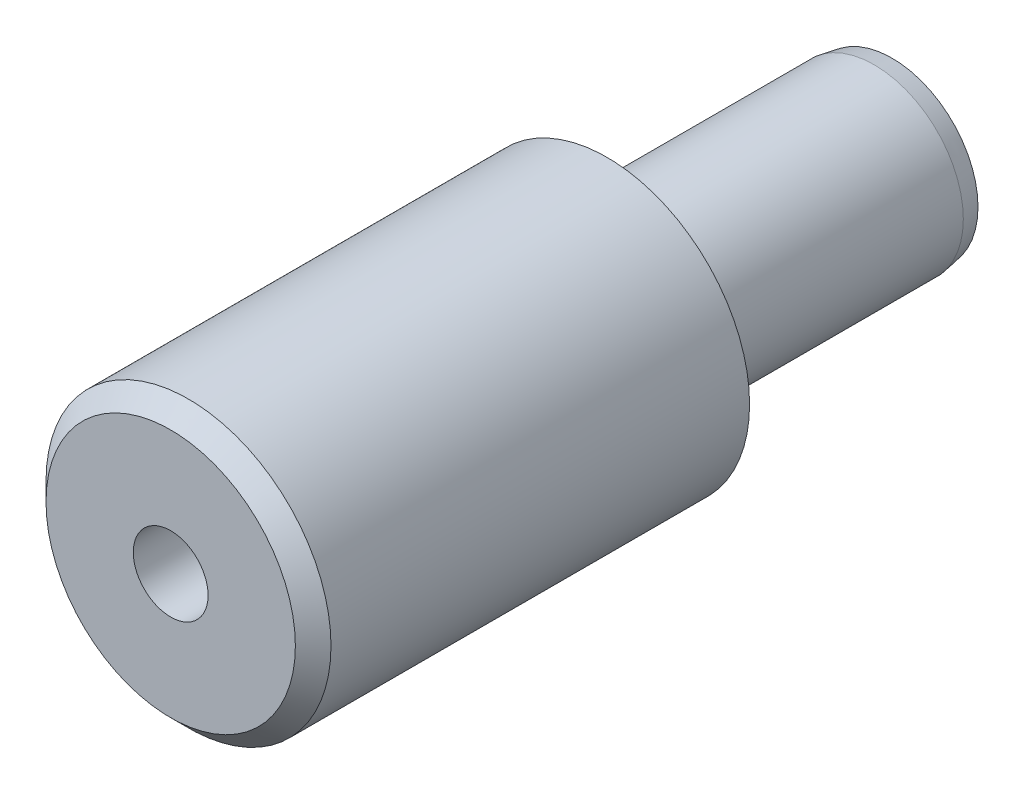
ISO-10303-21;
HEADER;
FILE_DESCRIPTION(('STEP AP214'),'2;1');
FILE_NAME('part.step','',(''),(''),'','','');
FILE_SCHEMA(('AUTOMOTIVE_DESIGN { 1 0 10303 214 1 1 1 1 }'));
ENDSEC;
DATA;
#1=APPLICATION_CONTEXT('core data for automotive mechanical design processes');
#2=APPLICATION_PROTOCOL_DEFINITION('international standard','automotive_design',2000,#1);
#3=PRODUCT_CONTEXT('',#1,'mechanical');
#4=PRODUCT('Part','Part','',(#3));
#5=PRODUCT_RELATED_PRODUCT_CATEGORY('part','',(#4));
#6=PRODUCT_DEFINITION_FORMATION('','',#4);
#7=PRODUCT_DEFINITION_CONTEXT('part definition',#1,'design');
#8=PRODUCT_DEFINITION('design','',#6,#7);
#9=PRODUCT_DEFINITION_SHAPE('','',#8);
#10=(LENGTH_UNIT() NAMED_UNIT(*) SI_UNIT(.MILLI.,.METRE.));
#11=(NAMED_UNIT(*) PLANE_ANGLE_UNIT() SI_UNIT($,.RADIAN.));
#12=(NAMED_UNIT(*) SI_UNIT($,.STERADIAN.) SOLID_ANGLE_UNIT());
#13=UNCERTAINTY_MEASURE_WITH_UNIT(LENGTH_MEASURE(1.E-05),#10,'distance_accuracy_value','');
#14=(GEOMETRIC_REPRESENTATION_CONTEXT(3) GLOBAL_UNCERTAINTY_ASSIGNED_CONTEXT((#13)) GLOBAL_UNIT_ASSIGNED_CONTEXT((#10,
#11,#12)) REPRESENTATION_CONTEXT('',''));
#15=CARTESIAN_POINT('',(0.,0.,0.));
#16=DIRECTION('',(0.,0.,1.));
#17=DIRECTION('',(1.,0.,0.));
#18=AXIS2_PLACEMENT_3D('',#15,#16,#17);
#19=CARTESIAN_POINT('',(0.,0.,0.5));
#20=DIRECTION('',(0.,0.,-1.));
#21=DIRECTION('',(-1.,0.,0.));
#22=AXIS2_PLACEMENT_3D('',#19,#20,#21);
#23=PLANE('',#22);
#24=CARTESIAN_POINT('',(0.,0.,0.5));
#25=DIRECTION('',(0.,0.,-1.));
#26=DIRECTION('',(-1.,0.,0.));
#27=AXIS2_PLACEMENT_3D('',#24,#25,#26);
#28=CIRCLE('',#27,5.8);
#29=CARTESIAN_POINT('',(-5.8,0.,0.500000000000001));
#30=VERTEX_POINT('',#29);
#31=EDGE_CURVE('E73',#30,#30,#28,.F.);
#32=ORIENTED_EDGE('',*,*,#31,.T.);
#33=EDGE_LOOP('',(#32));
#34=FACE_BOUND('',#33,.T.);
#35=CARTESIAN_POINT('',(0.,0.,0.5));
#36=DIRECTION('',(0.,0.,1.));
#37=DIRECTION('',(1.,0.,0.));
#38=AXIS2_PLACEMENT_3D('',#35,#36,#37);
#39=CIRCLE('',#38,8.);
#40=CARTESIAN_POINT('',(8.,0.,0.499999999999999));
#41=VERTEX_POINT('',#40);
#42=EDGE_CURVE('E70',#41,#41,#39,.T.);
#43=ORIENTED_EDGE('',*,*,#42,.F.);
#44=EDGE_LOOP('',(#43));
#45=FACE_BOUND('',#44,.T.);
#46=ADVANCED_FACE('F39',(#34,#45),#23,.T.);
#47=CARTESIAN_POINT('',(0.,0.,0.5));
#48=DIRECTION('',(0.,0.,1.));
#49=DIRECTION('',(1.,0.,0.));
#50=AXIS2_PLACEMENT_3D('',#47,#48,#49);
#51=CYLINDRICAL_SURFACE('',#50,8.);
#52=CARTESIAN_POINT('',(0.,0.,24.));
#53=DIRECTION('',(0.,0.,1.));
#54=DIRECTION('',(1.,0.,0.));
#55=AXIS2_PLACEMENT_3D('',#52,#53,#54);
#56=CIRCLE('',#55,8.);
#57=CARTESIAN_POINT('',(8.,0.,24.));
#58=VERTEX_POINT('',#57);
#59=EDGE_CURVE('E11',#58,#58,#56,.F.);
#60=ORIENTED_EDGE('',*,*,#59,.T.);
#61=EDGE_LOOP('',(#60));
#62=FACE_BOUND('',#61,.T.);
#63=ORIENTED_EDGE('',*,*,#42,.T.);
#64=EDGE_LOOP('',(#63));
#65=FACE_BOUND('',#64,.T.);
#66=ADVANCED_FACE('F93',(#62,#65),#51,.T.);
#67=CARTESIAN_POINT('',(0.,0.,25.));
#68=DIRECTION('',(0.,0.,1.));
#69=DIRECTION('',(1.,0.,0.));
#70=AXIS2_PLACEMENT_3D('',#67,#68,#69);
#71=PLANE('',#70);
#72=CARTESIAN_POINT('',(0.,0.,25.));
#73=DIRECTION('',(0.,0.,1.));
#74=DIRECTION('',(1.,0.,0.));
#75=AXIS2_PLACEMENT_3D('',#72,#73,#74);
#76=CIRCLE('',#75,7.);
#77=CARTESIAN_POINT('',(7.,0.,25.));
#78=VERTEX_POINT('',#77);
#79=EDGE_CURVE('E46',#78,#78,#76,.T.);
#80=ORIENTED_EDGE('',*,*,#79,.T.);
#81=EDGE_LOOP('',(#80));
#82=FACE_BOUND('',#81,.T.);
#83=CARTESIAN_POINT('',(0.,0.,25.));
#84=DIRECTION('',(0.,0.,1.));
#85=DIRECTION('',(1.,0.,0.));
#86=AXIS2_PLACEMENT_3D('',#83,#84,#85);
#87=CIRCLE('',#86,2.1);
#88=CARTESIAN_POINT('',(2.1,0.,25.));
#89=VERTEX_POINT('',#88);
#90=EDGE_CURVE('E60',#89,#89,#87,.T.);
#91=ORIENTED_EDGE('',*,*,#90,.F.);
#92=EDGE_LOOP('',(#91));
#93=FACE_BOUND('',#92,.T.);
#94=ADVANCED_FACE('F81',(#82,#93),#71,.T.);
#95=CARTESIAN_POINT('',(0.,0.,-15.5));
#96=DIRECTION('',(0.,0.,1.));
#97=DIRECTION('',(1.,0.,0.));
#98=AXIS2_PLACEMENT_3D('',#95,#96,#97);
#99=CYLINDRICAL_SURFACE('',#98,5.);
#100=CARTESIAN_POINT('',(0.,0.,-0.3));
#101=DIRECTION('',(0.,0.,-1.));
#102=DIRECTION('',(-1.,0.,0.));
#103=AXIS2_PLACEMENT_3D('',#100,#101,#102);
#104=CIRCLE('',#103,5.);
#105=CARTESIAN_POINT('',(-5.,0.,-0.299999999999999));
#106=VERTEX_POINT('',#105);
#107=EDGE_CURVE('E76',#106,#106,#104,.T.);
#108=ORIENTED_EDGE('',*,*,#107,.T.);
#109=EDGE_LOOP('',(#108));
#110=FACE_BOUND('',#109,.T.);
#111=CARTESIAN_POINT('',(0.,0.,-14.5));
#112=DIRECTION('',(0.,0.,1.));
#113=DIRECTION('',(1.,0.,0.));
#114=AXIS2_PLACEMENT_3D('',#111,#112,#113);
#115=CIRCLE('',#114,5.);
#116=CARTESIAN_POINT('',(5.,0.,-14.5));
#117=VERTEX_POINT('',#116);
#118=EDGE_CURVE('E63',#117,#117,#115,.T.);
#119=ORIENTED_EDGE('',*,*,#118,.T.);
#120=EDGE_LOOP('',(#119));
#121=FACE_BOUND('',#120,.T.);
#122=ADVANCED_FACE('F105',(#110,#121),#99,.T.);
#123=CARTESIAN_POINT('',(0.,0.,-14.5));
#124=DIRECTION('',(0.,0.,1.));
#125=DIRECTION('',(1.,0.,0.));
#126=AXIS2_PLACEMENT_3D('',#123,#124,#125);
#127=CONICAL_SURFACE('',#126,5.,0.174532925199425);
#128=CARTESIAN_POINT('',(0.,0.,-15.5));
#129=DIRECTION('',(0.,0.,1.));
#130=DIRECTION('',(1.,0.,0.));
#131=AXIS2_PLACEMENT_3D('',#128,#129,#130);
#132=CIRCLE('',#131,4.82367301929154);
#133=CARTESIAN_POINT('',(4.82367301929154,0.,-15.5));
#134=VERTEX_POINT('',#133);
#135=EDGE_CURVE('E59',#134,#134,#132,.T.);
#136=ORIENTED_EDGE('',*,*,#135,.T.);
#137=EDGE_LOOP('',(#136));
#138=FACE_BOUND('',#137,.T.);
#139=ORIENTED_EDGE('',*,*,#118,.F.);
#140=EDGE_LOOP('',(#139));
#141=FACE_BOUND('',#140,.T.);
#142=ADVANCED_FACE('F108',(#138,#141),#127,.T.);
#143=CARTESIAN_POINT('',(0.,0.,-15.5));
#144=DIRECTION('',(0.,0.,-1.));
#145=DIRECTION('',(-1.,0.,0.));
#146=AXIS2_PLACEMENT_3D('',#143,#144,#145);
#147=PLANE('',#146);
#148=ORIENTED_EDGE('',*,*,#135,.F.);
#149=EDGE_LOOP('',(#148));
#150=FACE_BOUND('',#149,.T.);
#151=ADVANCED_FACE('F53',(#150),#147,.T.);
#152=CARTESIAN_POINT('',(0.,0.,12.));
#153=DIRECTION('',(0.,0.,1.));
#154=DIRECTION('',(1.,0.,0.));
#155=AXIS2_PLACEMENT_3D('',#152,#153,#154);
#156=CONICAL_SURFACE('',#155,2.1,1.02974425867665);
#157=CARTESIAN_POINT('',(0.,0.,10.7381927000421));
#158=VERTEX_POINT('',#157);
#159=VERTEX_LOOP('',#158);
#160=FACE_BOUND('',#159,.T.);
#161=CARTESIAN_POINT('',(0.,0.,12.));
#162=DIRECTION('',(0.,0.,1.));
#163=DIRECTION('',(1.,0.,0.));
#164=AXIS2_PLACEMENT_3D('',#161,#162,#163);
#165=CIRCLE('',#164,2.1);
#166=CARTESIAN_POINT('',(2.1,0.,12.));
#167=VERTEX_POINT('',#166);
#168=EDGE_CURVE('E57',#167,#167,#165,.T.);
#169=ORIENTED_EDGE('',*,*,#168,.T.);
#170=EDGE_LOOP('',(#169));
#171=FACE_BOUND('',#170,.T.);
#172=ADVANCED_FACE('F49',(#160,#171),#156,.F.);
#173=CARTESIAN_POINT('',(0.,0.,25.));
#174=DIRECTION('',(0.,0.,1.));
#175=DIRECTION('',(1.,0.,0.));
#176=AXIS2_PLACEMENT_3D('',#173,#174,#175);
#177=CYLINDRICAL_SURFACE('',#176,2.1);
#178=ORIENTED_EDGE('',*,*,#168,.F.);
#179=EDGE_LOOP('',(#178));
#180=FACE_BOUND('',#179,.T.);
#181=ORIENTED_EDGE('',*,*,#90,.T.);
#182=EDGE_LOOP('',(#181));
#183=FACE_BOUND('',#182,.T.);
#184=ADVANCED_FACE('F52',(#180,#183),#177,.F.);
#185=CARTESIAN_POINT('',(0.,0.,-0.3));
#186=DIRECTION('',(0.,0.,-1.));
#187=DIRECTION('',(-1.,0.,0.));
#188=AXIS2_PLACEMENT_3D('',#185,#186,#187);
#189=TOROIDAL_SURFACE('',#188,5.8,0.8);
#190=ORIENTED_EDGE('',*,*,#107,.F.);
#191=EDGE_LOOP('',(#190));
#192=FACE_BOUND('',#191,.T.);
#193=ORIENTED_EDGE('',*,*,#31,.F.);
#194=EDGE_LOOP('',(#193));
#195=FACE_BOUND('',#194,.T.);
#196=ADVANCED_FACE('F85',(#192,#195),#189,.F.);
#197=CARTESIAN_POINT('',(0.,0.,25.));
#198=DIRECTION('',(0.,0.,-1.));
#199=DIRECTION('',(-1.,0.,0.));
#200=AXIS2_PLACEMENT_3D('',#197,#198,#199);
#201=CONICAL_SURFACE('',#200,7.,0.785398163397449);
#202=ORIENTED_EDGE('',*,*,#59,.F.);
#203=EDGE_LOOP('',(#202));
#204=FACE_BOUND('',#203,.T.);
#205=ORIENTED_EDGE('',*,*,#79,.F.);
#206=EDGE_LOOP('',(#205));
#207=FACE_BOUND('',#206,.T.);
#208=ADVANCED_FACE('F41',(#204,#207),#201,.T.);
#209=CLOSED_SHELL('',(#46,#66,#94,#122,#142,#151,#172,#184,#196,#208));
#210=MANIFOLD_SOLID_BREP('B2',#209);
#211=ADVANCED_BREP_SHAPE_REPRESENTATION('',(#18,#210),#14);
#212=SHAPE_DEFINITION_REPRESENTATION(#9,#211);
ENDSEC;
END-ISO-10303-21;
